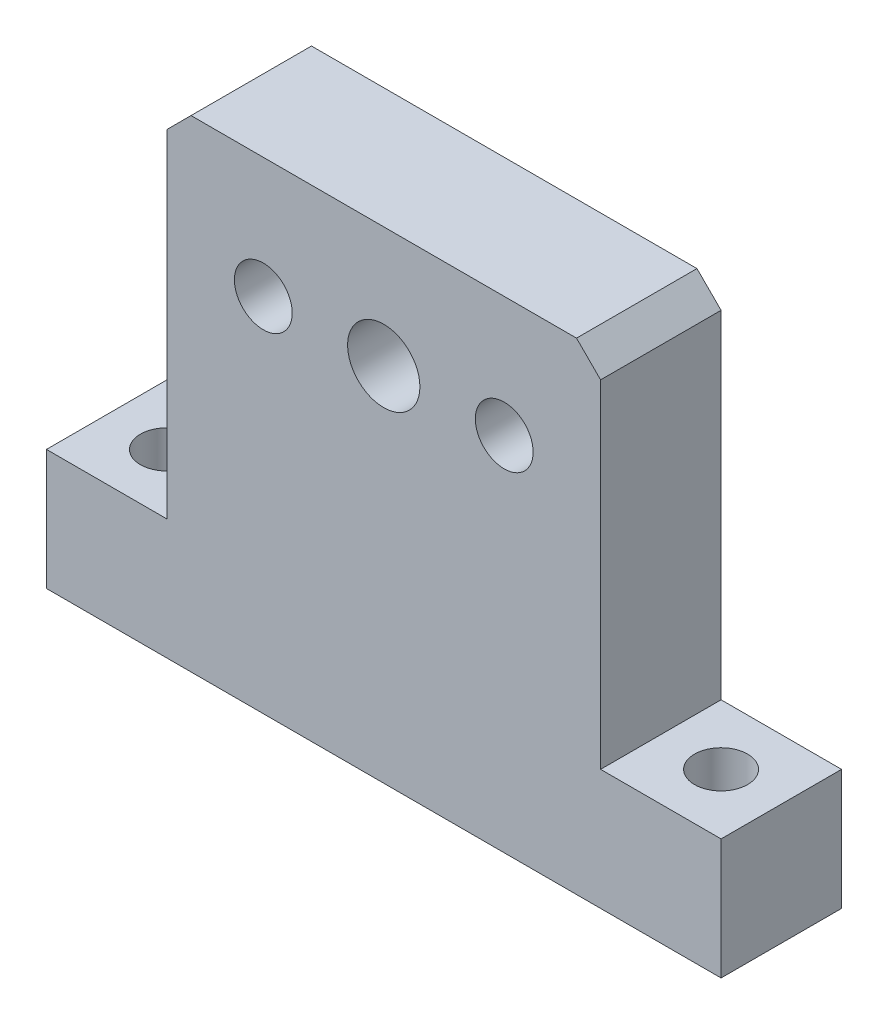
from build123d import *

# Parameters (mm, degrees)
SKETCH_1_W          = 140
SKETCH_1_H          = 100
EXTRUDE_1_DEPTH     = 25
SKETCH_2_W          = 25
SKETCH_2_H          = 75
CUT_EXTRUDE_1_DEPTH = 125.599357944
SKETCH_3_R          = 7.5
CUT_EXTRUDE_2_DEPTH = 125.599357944
SKETCH_4_R          = 6
CUT_EXTRUDE_3_DEPTH = 125.599357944
SKETCH_5_R          = 5.5
CUT_EXTRUDE_4_DEPTH = 106.59356041
CHAMFER_1_SIZE      = 5


with BuildPart() as part:
    # Sketch 1 → Extrude 1 (new body)
    with BuildSketch(Plane.XY):
        with Locations((0, 50)):
            Rectangle(SKETCH_1_W, SKETCH_1_H)
    extrude(amount=EXTRUDE_1_DEPTH)

    # Sketch 2 → Cut-Extrude 1 (cut, through all)
    with BuildSketch(Plane.XY.offset(25)):
        with Locations((57.5, 62.5)):
            Rectangle(SKETCH_2_W, SKETCH_2_H)
        with Locations((-57.5, 62.5)):
            Rectangle(SKETCH_2_W, SKETCH_2_H)
    extrude(amount=-CUT_EXTRUDE_1_DEPTH, mode=Mode.SUBTRACT)

    # Sketch 3 → Cut-Extrude 2 (cut, through all)
    with BuildSketch(Plane.XY.offset(25)):
        with Locations((0, 75)):
            Circle(SKETCH_3_R)
    extrude(amount=-CUT_EXTRUDE_2_DEPTH, mode=Mode.SUBTRACT)

    # Sketch 4 → Cut-Extrude 3 (cut, through all)
    with BuildSketch(Plane.XY.offset(25)):
        with Locations((-25, 75)):
            Circle(SKETCH_4_R)
        with Locations((25, 75)):
            Circle(SKETCH_4_R)
    extrude(amount=-CUT_EXTRUDE_3_DEPTH, mode=Mode.SUBTRACT)

    # Sketch 5 → Cut-Extrude 4 (cut, through all)
    with BuildSketch(Plane(origin=(0, 25, 0), x_dir=(1, 0, 0), z_dir=(0, 1, 0))):
        with Locations(Location((-57.5, -12.5, 0), (0, 0, 270))):
            Circle(SKETCH_5_R)
        with Locations(Location((57.5, -12.5, 0), (0, 0, 270))):
            Circle(SKETCH_5_R)
    extrude(amount=-CUT_EXTRUDE_4_DEPTH, mode=Mode.SUBTRACT)

    # Chamfer 1
    chamfer_1_edges = [part.edges().sort_by_distance(p)[0] for p in [
        (-45, 100, 12.5),
        (45, 100, 12.5),
    ]]
    chamfer(chamfer_1_edges, length=CHAMFER_1_SIZE)


solid = part.part
